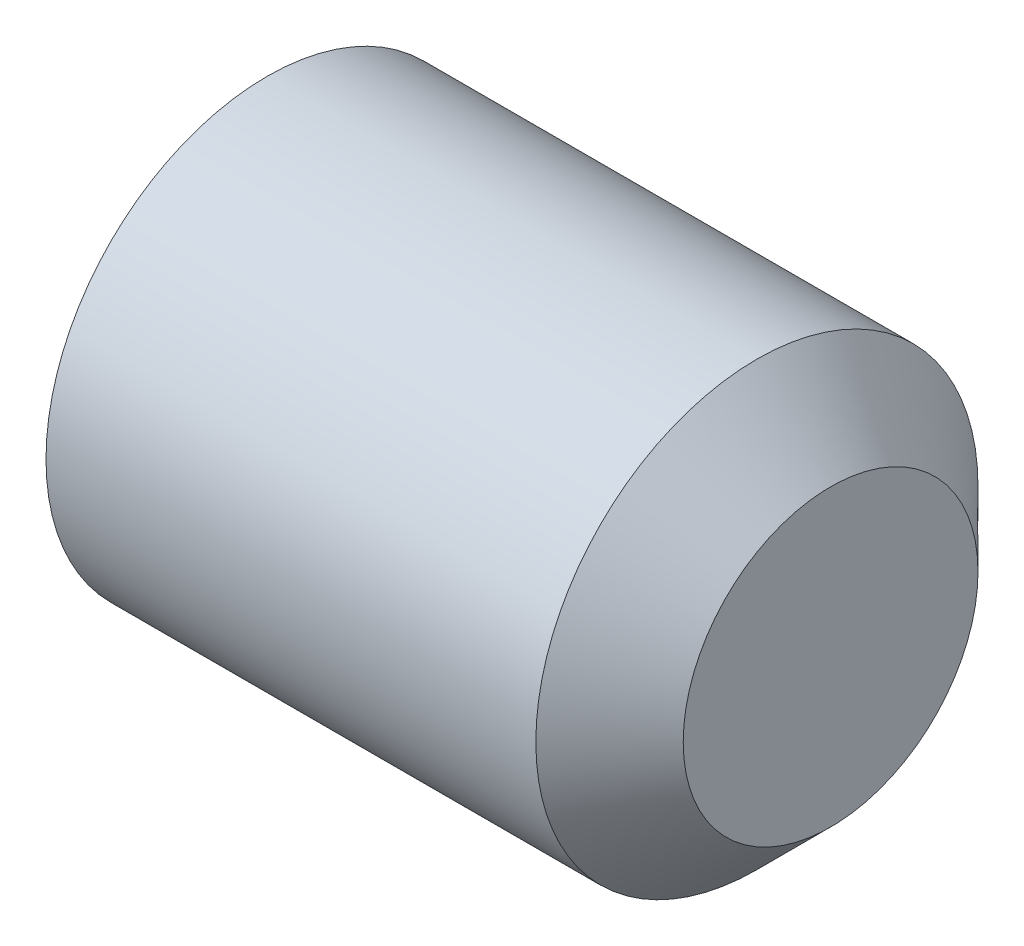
ISO-10303-21;
HEADER;
FILE_DESCRIPTION(('STEP AP214'),'2;1');
FILE_NAME('part.step','',(''),(''),'','','');
FILE_SCHEMA(('AUTOMOTIVE_DESIGN { 1 0 10303 214 1 1 1 1 }'));
ENDSEC;
DATA;
#1=APPLICATION_CONTEXT('core data for automotive mechanical design processes');
#2=APPLICATION_PROTOCOL_DEFINITION('international standard','automotive_design',2000,#1);
#3=PRODUCT_CONTEXT('',#1,'mechanical');
#4=PRODUCT('Part','Part','',(#3));
#5=PRODUCT_RELATED_PRODUCT_CATEGORY('part','',(#4));
#6=PRODUCT_DEFINITION_FORMATION('','',#4);
#7=PRODUCT_DEFINITION_CONTEXT('part definition',#1,'design');
#8=PRODUCT_DEFINITION('design','',#6,#7);
#9=PRODUCT_DEFINITION_SHAPE('','',#8);
#10=(LENGTH_UNIT() NAMED_UNIT(*) SI_UNIT(.MILLI.,.METRE.));
#11=(NAMED_UNIT(*) PLANE_ANGLE_UNIT() SI_UNIT($,.RADIAN.));
#12=(NAMED_UNIT(*) SI_UNIT($,.STERADIAN.) SOLID_ANGLE_UNIT());
#13=UNCERTAINTY_MEASURE_WITH_UNIT(LENGTH_MEASURE(1.E-05),#10,'distance_accuracy_value','');
#14=(GEOMETRIC_REPRESENTATION_CONTEXT(3) GLOBAL_UNCERTAINTY_ASSIGNED_CONTEXT((#13)) GLOBAL_UNIT_ASSIGNED_CONTEXT((#10,
#11,#12)) REPRESENTATION_CONTEXT('',''));
#15=CARTESIAN_POINT('',(0.,0.,0.));
#16=DIRECTION('',(0.,0.,1.));
#17=DIRECTION('',(1.,0.,0.));
#18=AXIS2_PLACEMENT_3D('',#15,#16,#17);
#19=CARTESIAN_POINT('',(-4.,1.194,0.));
#20=DIRECTION('',(1.,0.,0.));
#21=DIRECTION('',(0.,0.,-1.));
#22=AXIS2_PLACEMENT_3D('',#19,#20,#21);
#23=PLANE('',#22);
#24=CARTESIAN_POINT('',(-4.,0.,0.));
#25=DIRECTION('',(-1.,0.,0.));
#26=DIRECTION('',(0.,0.,1.));
#27=AXIS2_PLACEMENT_3D('',#24,#25,#26);
#28=CIRCLE('',#27,1.194);
#29=CARTESIAN_POINT('',(-4.,0.,1.194));
#30=VERTEX_POINT('',#29);
#31=EDGE_CURVE('E141',#30,#30,#28,.T.);
#32=ORIENTED_EDGE('',*,*,#31,.T.);
#33=EDGE_LOOP('',(#32));
#34=FACE_BOUND('',#33,.T.);
#35=DIRECTION('',(0.,0.5,-0.866025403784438));
#36=VECTOR('',#35,1.);
#37=CARTESIAN_POINT('',(-4.,-0.866025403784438,0.));
#38=LINE('',#37,#36);
#39=CARTESIAN_POINT('',(-4.,-0.866025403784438,0.));
#40=VERTEX_POINT('',#39);
#41=CARTESIAN_POINT('',(-4.,-0.433012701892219,-0.75));
#42=VERTEX_POINT('',#41);
#43=EDGE_CURVE('E50',#40,#42,#38,.T.);
#44=ORIENTED_EDGE('',*,*,#43,.T.);
#45=DIRECTION('',(0.,1.,0.));
#46=VECTOR('',#45,1.);
#47=CARTESIAN_POINT('',(-4.,-0.433012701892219,-0.75));
#48=LINE('',#47,#46);
#49=CARTESIAN_POINT('',(-4.,0.433012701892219,-0.75));
#50=VERTEX_POINT('',#49);
#51=EDGE_CURVE('E121',#42,#50,#48,.T.);
#52=ORIENTED_EDGE('',*,*,#51,.T.);
#53=DIRECTION('',(0.,0.5,0.866025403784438));
#54=VECTOR('',#53,1.);
#55=CARTESIAN_POINT('',(-4.,0.433012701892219,-0.75));
#56=LINE('',#55,#54);
#57=CARTESIAN_POINT('',(-4.,0.866025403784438,0.));
#58=VERTEX_POINT('',#57);
#59=EDGE_CURVE('E124',#50,#58,#56,.T.);
#60=ORIENTED_EDGE('',*,*,#59,.T.);
#61=DIRECTION('',(0.,-0.5,0.866025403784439));
#62=VECTOR('',#61,1.);
#63=CARTESIAN_POINT('',(-4.,0.866025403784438,0.));
#64=LINE('',#63,#62);
#65=CARTESIAN_POINT('',(-4.,0.433012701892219,0.75));
#66=VERTEX_POINT('',#65);
#67=EDGE_CURVE('E127',#58,#66,#64,.T.);
#68=ORIENTED_EDGE('',*,*,#67,.T.);
#69=DIRECTION('',(0.,-1.,0.));
#70=VECTOR('',#69,1.);
#71=CARTESIAN_POINT('',(-4.,0.433012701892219,0.75));
#72=LINE('',#71,#70);
#73=CARTESIAN_POINT('',(-4.,-0.433012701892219,0.75));
#74=VERTEX_POINT('',#73);
#75=EDGE_CURVE('E111',#66,#74,#72,.T.);
#76=ORIENTED_EDGE('',*,*,#75,.T.);
#77=DIRECTION('',(0.,-0.5,-0.866025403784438));
#78=VECTOR('',#77,1.);
#79=CARTESIAN_POINT('',(-4.,-0.433012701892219,0.75));
#80=LINE('',#79,#78);
#81=EDGE_CURVE('E130',#74,#40,#80,.T.);
#82=ORIENTED_EDGE('',*,*,#81,.T.);
#83=EDGE_LOOP('',(#44,#52,#60,#68,#76,#82));
#84=FACE_BOUND('',#83,.T.);
#85=ADVANCED_FACE('F35',(#34,#84),#23,.F.);
#86=CARTESIAN_POINT('',(0.,0.,0.));
#87=DIRECTION('',(-1.,0.,0.));
#88=DIRECTION('',(0.,0.,1.));
#89=AXIS2_PLACEMENT_3D('',#86,#87,#88);
#90=PLANE('',#89);
#91=CARTESIAN_POINT('',(0.,0.,0.));
#92=DIRECTION('',(-1.,0.,0.));
#93=DIRECTION('',(0.,0.,1.));
#94=AXIS2_PLACEMENT_3D('',#91,#92,#93);
#95=CIRCLE('',#94,1.);
#96=CARTESIAN_POINT('',(0.,0.,1.));
#97=VERTEX_POINT('',#96);
#98=EDGE_CURVE('E11',#97,#97,#95,.T.);
#99=ORIENTED_EDGE('',*,*,#98,.F.);
#100=EDGE_LOOP('',(#99));
#101=FACE_BOUND('',#100,.T.);
#102=ADVANCED_FACE('F37',(#101),#90,.F.);
#103=CARTESIAN_POINT('',(0.,0.,0.));
#104=DIRECTION('',(-1.,0.,0.));
#105=DIRECTION('',(0.,0.,1.));
#106=AXIS2_PLACEMENT_3D('',#103,#104,#105);
#107=CONICAL_SURFACE('',#106,1.,0.785398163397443);
#108=CARTESIAN_POINT('',(-0.500000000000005,0.,0.));
#109=DIRECTION('',(-1.,0.,0.));
#110=DIRECTION('',(0.,0.,1.));
#111=AXIS2_PLACEMENT_3D('',#108,#109,#110);
#112=CIRCLE('',#111,1.5);
#113=CARTESIAN_POINT('',(-0.500000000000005,0.,1.5));
#114=VERTEX_POINT('',#113);
#115=EDGE_CURVE('E43',#114,#114,#112,.T.);
#116=ORIENTED_EDGE('',*,*,#115,.F.);
#117=EDGE_LOOP('',(#116));
#118=FACE_BOUND('',#117,.T.);
#119=ORIENTED_EDGE('',*,*,#98,.T.);
#120=EDGE_LOOP('',(#119));
#121=FACE_BOUND('',#120,.T.);
#122=ADVANCED_FACE('F151',(#118,#121),#107,.T.);
#123=CARTESIAN_POINT('',(-4.,0.,0.));
#124=DIRECTION('',(-1.,0.,0.));
#125=DIRECTION('',(0.,0.,1.));
#126=AXIS2_PLACEMENT_3D('',#123,#124,#125);
#127=CYLINDRICAL_SURFACE('',#126,1.5);
#128=CARTESIAN_POINT('',(-3.82333081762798,0.,0.));
#129=DIRECTION('',(-1.,0.,0.));
#130=DIRECTION('',(0.,0.,1.));
#131=AXIS2_PLACEMENT_3D('',#128,#129,#130);
#132=CIRCLE('',#131,1.5);
#133=CARTESIAN_POINT('',(-3.82333081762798,0.,1.5));
#134=VERTEX_POINT('',#133);
#135=EDGE_CURVE('E144',#134,#134,#132,.T.);
#136=ORIENTED_EDGE('',*,*,#135,.F.);
#137=EDGE_LOOP('',(#136));
#138=FACE_BOUND('',#137,.T.);
#139=ORIENTED_EDGE('',*,*,#115,.T.);
#140=EDGE_LOOP('',(#139));
#141=FACE_BOUND('',#140,.T.);
#142=ADVANCED_FACE('F149',(#138,#141),#127,.T.);
#143=CARTESIAN_POINT('',(-3.82333081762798,0.,0.));
#144=DIRECTION('',(1.,0.,0.));
#145=DIRECTION('',(0.,0.,-1.));
#146=AXIS2_PLACEMENT_3D('',#143,#144,#145);
#147=CONICAL_SURFACE('',#146,1.5,1.0471975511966);
#148=ORIENTED_EDGE('',*,*,#31,.F.);
#149=EDGE_LOOP('',(#148));
#150=FACE_BOUND('',#149,.T.);
#151=ORIENTED_EDGE('',*,*,#135,.T.);
#152=EDGE_LOOP('',(#151));
#153=FACE_BOUND('',#152,.T.);
#154=ADVANCED_FACE('F169',(#150,#153),#147,.T.);
#155=CARTESIAN_POINT('',(-2.8,-0.866025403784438,0.));
#156=DIRECTION('',(0.,0.866025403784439,0.5));
#157=DIRECTION('',(0.,-0.5,0.866025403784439));
#158=AXIS2_PLACEMENT_3D('',#155,#156,#157);
#159=PLANE('',#158);
#160=ORIENTED_EDGE('',*,*,#43,.F.);
#161=DIRECTION('',(-1.,0.,0.));
#162=VECTOR('',#161,1.);
#163=CARTESIAN_POINT('',(-2.8,-0.866025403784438,0.));
#164=LINE('',#163,#162);
#165=CARTESIAN_POINT('',(-2.8,-0.866025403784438,0.));
#166=VERTEX_POINT('',#165);
#167=EDGE_CURVE('E116',#166,#40,#164,.T.);
#168=ORIENTED_EDGE('',*,*,#167,.F.);
#169=DIRECTION('',(0.,0.5,-0.866025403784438));
#170=VECTOR('',#169,1.);
#171=CARTESIAN_POINT('',(-2.8,-0.866025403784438,0.));
#172=LINE('',#171,#170);
#173=CARTESIAN_POINT('',(-2.8,-0.433012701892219,-0.75));
#174=VERTEX_POINT('',#173);
#175=EDGE_CURVE('E133',#166,#174,#172,.T.);
#176=ORIENTED_EDGE('',*,*,#175,.T.);
#177=DIRECTION('',(-1.,0.,0.));
#178=VECTOR('',#177,1.);
#179=CARTESIAN_POINT('',(-2.8,-0.433012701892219,-0.75));
#180=LINE('',#179,#178);
#181=EDGE_CURVE('E139',#174,#42,#180,.T.);
#182=ORIENTED_EDGE('',*,*,#181,.T.);
#183=EDGE_LOOP('',(#160,#168,#176,#182));
#184=FACE_BOUND('',#183,.T.);
#185=ADVANCED_FACE('F167',(#184),#159,.T.);
#186=CARTESIAN_POINT('',(-2.8,-0.433012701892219,-0.75));
#187=DIRECTION('',(0.,0.,1.));
#188=DIRECTION('',(1.,0.,0.));
#189=AXIS2_PLACEMENT_3D('',#186,#187,#188);
#190=PLANE('',#189);
#191=ORIENTED_EDGE('',*,*,#51,.F.);
#192=ORIENTED_EDGE('',*,*,#181,.F.);
#193=DIRECTION('',(0.,1.,0.));
#194=VECTOR('',#193,1.);
#195=CARTESIAN_POINT('',(-2.8,-0.433012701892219,-0.75));
#196=LINE('',#195,#194);
#197=CARTESIAN_POINT('',(-2.8,0.433012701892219,-0.75));
#198=VERTEX_POINT('',#197);
#199=EDGE_CURVE('E89',#174,#198,#196,.T.);
#200=ORIENTED_EDGE('',*,*,#199,.T.);
#201=DIRECTION('',(-1.,0.,0.));
#202=VECTOR('',#201,1.);
#203=CARTESIAN_POINT('',(-2.8,0.433012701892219,-0.75));
#204=LINE('',#203,#202);
#205=EDGE_CURVE('E137',#198,#50,#204,.T.);
#206=ORIENTED_EDGE('',*,*,#205,.T.);
#207=EDGE_LOOP('',(#191,#192,#200,#206));
#208=FACE_BOUND('',#207,.T.);
#209=ADVANCED_FACE('F192',(#208),#190,.T.);
#210=CARTESIAN_POINT('',(-2.8,0.433012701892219,-0.75));
#211=DIRECTION('',(0.,-0.866025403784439,0.5));
#212=DIRECTION('',(0.,-0.5,-0.866025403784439));
#213=AXIS2_PLACEMENT_3D('',#210,#211,#212);
#214=PLANE('',#213);
#215=ORIENTED_EDGE('',*,*,#59,.F.);
#216=ORIENTED_EDGE('',*,*,#205,.F.);
#217=DIRECTION('',(0.,0.5,0.866025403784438));
#218=VECTOR('',#217,1.);
#219=CARTESIAN_POINT('',(-2.8,0.433012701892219,-0.75));
#220=LINE('',#219,#218);
#221=CARTESIAN_POINT('',(-2.8,0.866025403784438,0.));
#222=VERTEX_POINT('',#221);
#223=EDGE_CURVE('E107',#198,#222,#220,.T.);
#224=ORIENTED_EDGE('',*,*,#223,.T.);
#225=DIRECTION('',(-1.,0.,0.));
#226=VECTOR('',#225,1.);
#227=CARTESIAN_POINT('',(-2.8,0.866025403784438,0.));
#228=LINE('',#227,#226);
#229=EDGE_CURVE('E104',#222,#58,#228,.T.);
#230=ORIENTED_EDGE('',*,*,#229,.T.);
#231=EDGE_LOOP('',(#215,#216,#224,#230));
#232=FACE_BOUND('',#231,.T.);
#233=ADVANCED_FACE('F198',(#232),#214,.T.);
#234=CARTESIAN_POINT('',(-2.8,0.866025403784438,0.));
#235=DIRECTION('',(0.,-0.866025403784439,-0.5));
#236=DIRECTION('',(0.,0.5,-0.866025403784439));
#237=AXIS2_PLACEMENT_3D('',#234,#235,#236);
#238=PLANE('',#237);
#239=ORIENTED_EDGE('',*,*,#67,.F.);
#240=ORIENTED_EDGE('',*,*,#229,.F.);
#241=DIRECTION('',(0.,-0.5,0.866025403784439));
#242=VECTOR('',#241,1.);
#243=CARTESIAN_POINT('',(-2.8,0.866025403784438,0.));
#244=LINE('',#243,#242);
#245=CARTESIAN_POINT('',(-2.8,0.433012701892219,0.75));
#246=VERTEX_POINT('',#245);
#247=EDGE_CURVE('E99',#222,#246,#244,.T.);
#248=ORIENTED_EDGE('',*,*,#247,.T.);
#249=DIRECTION('',(-1.,0.,0.));
#250=VECTOR('',#249,1.);
#251=CARTESIAN_POINT('',(-2.8,0.433012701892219,0.75));
#252=LINE('',#251,#250);
#253=EDGE_CURVE('E103',#246,#66,#252,.T.);
#254=ORIENTED_EDGE('',*,*,#253,.T.);
#255=EDGE_LOOP('',(#239,#240,#248,#254));
#256=FACE_BOUND('',#255,.T.);
#257=ADVANCED_FACE('F102',(#256),#238,.T.);
#258=CARTESIAN_POINT('',(-2.8,0.433012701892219,0.75));
#259=DIRECTION('',(0.,0.,-1.));
#260=DIRECTION('',(-1.,0.,0.));
#261=AXIS2_PLACEMENT_3D('',#258,#259,#260);
#262=PLANE('',#261);
#263=ORIENTED_EDGE('',*,*,#75,.F.);
#264=ORIENTED_EDGE('',*,*,#253,.F.);
#265=DIRECTION('',(0.,-1.,0.));
#266=VECTOR('',#265,1.);
#267=CARTESIAN_POINT('',(-2.8,0.433012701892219,0.75));
#268=LINE('',#267,#266);
#269=CARTESIAN_POINT('',(-2.8,-0.433012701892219,0.75));
#270=VERTEX_POINT('',#269);
#271=EDGE_CURVE('E106',#246,#270,#268,.T.);
#272=ORIENTED_EDGE('',*,*,#271,.T.);
#273=DIRECTION('',(-1.,0.,0.));
#274=VECTOR('',#273,1.);
#275=CARTESIAN_POINT('',(-2.8,-0.433012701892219,0.75));
#276=LINE('',#275,#274);
#277=EDGE_CURVE('E80',#270,#74,#276,.T.);
#278=ORIENTED_EDGE('',*,*,#277,.T.);
#279=EDGE_LOOP('',(#263,#264,#272,#278));
#280=FACE_BOUND('',#279,.T.);
#281=ADVANCED_FACE('F109',(#280),#262,.T.);
#282=CARTESIAN_POINT('',(-2.8,-0.433012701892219,0.75));
#283=DIRECTION('',(0.,0.866025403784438,-0.5));
#284=DIRECTION('',(0.,0.5,0.866025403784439));
#285=AXIS2_PLACEMENT_3D('',#282,#283,#284);
#286=PLANE('',#285);
#287=ORIENTED_EDGE('',*,*,#81,.F.);
#288=ORIENTED_EDGE('',*,*,#277,.F.);
#289=DIRECTION('',(0.,-0.5,-0.866025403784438));
#290=VECTOR('',#289,1.);
#291=CARTESIAN_POINT('',(-2.8,-0.433012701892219,0.75));
#292=LINE('',#291,#290);
#293=EDGE_CURVE('E58',#270,#166,#292,.T.);
#294=ORIENTED_EDGE('',*,*,#293,.T.);
#295=ORIENTED_EDGE('',*,*,#167,.T.);
#296=EDGE_LOOP('',(#287,#288,#294,#295));
#297=FACE_BOUND('',#296,.T.);
#298=ADVANCED_FACE('F218',(#297),#286,.T.);
#299=CARTESIAN_POINT('',(-2.8,0.,0.));
#300=DIRECTION('',(1.,0.,0.));
#301=DIRECTION('',(0.,0.,-1.));
#302=AXIS2_PLACEMENT_3D('',#299,#300,#301);
#303=PLANE('',#302);
#304=ORIENTED_EDGE('',*,*,#175,.F.);
#305=ORIENTED_EDGE('',*,*,#293,.F.);
#306=ORIENTED_EDGE('',*,*,#271,.F.);
#307=ORIENTED_EDGE('',*,*,#247,.F.);
#308=ORIENTED_EDGE('',*,*,#223,.F.);
#309=ORIENTED_EDGE('',*,*,#199,.F.);
#310=EDGE_LOOP('',(#304,#305,#306,#307,#308,#309));
#311=FACE_BOUND('',#310,.T.);
#312=ADVANCED_FACE('F114',(#311),#303,.F.);
#313=CLOSED_SHELL('',(#85,#102,#122,#142,#154,#185,#209,#233,#257,#281,#298,#312));
#314=MANIFOLD_SOLID_BREP('B2',#313);
#315=ADVANCED_BREP_SHAPE_REPRESENTATION('',(#18,#314),#14);
#316=SHAPE_DEFINITION_REPRESENTATION(#9,#315);
ENDSEC;
END-ISO-10303-21;
